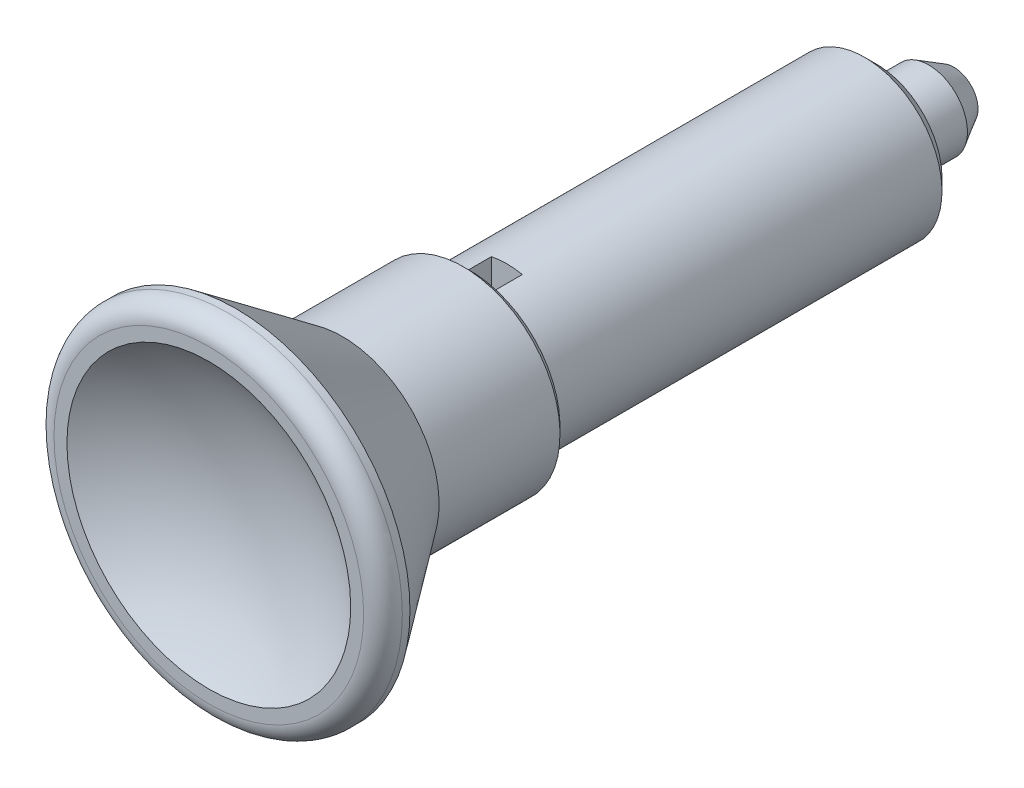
ISO-10303-21;
HEADER;
FILE_DESCRIPTION(('STEP AP214'),'2;1');
FILE_NAME('part.step','',(''),(''),'','','');
FILE_SCHEMA(('AUTOMOTIVE_DESIGN { 1 0 10303 214 1 1 1 1 }'));
ENDSEC;
DATA;
#1=APPLICATION_CONTEXT('core data for automotive mechanical design processes');
#2=APPLICATION_PROTOCOL_DEFINITION('international standard','automotive_design',2000,#1);
#3=PRODUCT_CONTEXT('',#1,'mechanical');
#4=PRODUCT('Part','Part','',(#3));
#5=PRODUCT_RELATED_PRODUCT_CATEGORY('part','',(#4));
#6=PRODUCT_DEFINITION_FORMATION('','',#4);
#7=PRODUCT_DEFINITION_CONTEXT('part definition',#1,'design');
#8=PRODUCT_DEFINITION('design','',#6,#7);
#9=PRODUCT_DEFINITION_SHAPE('','',#8);
#10=(LENGTH_UNIT() NAMED_UNIT(*) SI_UNIT(.MILLI.,.METRE.));
#11=(NAMED_UNIT(*) PLANE_ANGLE_UNIT() SI_UNIT($,.RADIAN.));
#12=(NAMED_UNIT(*) SI_UNIT($,.STERADIAN.) SOLID_ANGLE_UNIT());
#13=UNCERTAINTY_MEASURE_WITH_UNIT(LENGTH_MEASURE(1.E-05),#10,'distance_accuracy_value','');
#14=(GEOMETRIC_REPRESENTATION_CONTEXT(3) GLOBAL_UNCERTAINTY_ASSIGNED_CONTEXT((#13)) GLOBAL_UNIT_ASSIGNED_CONTEXT((#10,
#11,#12)) REPRESENTATION_CONTEXT('',''));
#15=CARTESIAN_POINT('',(0.,0.,0.));
#16=DIRECTION('',(0.,0.,1.));
#17=DIRECTION('',(1.,0.,0.));
#18=AXIS2_PLACEMENT_3D('',#15,#16,#17);
#19=CARTESIAN_POINT('',(-0.8,-10.,19.1));
#20=DIRECTION('',(0.,0.,1.));
#21=DIRECTION('',(0.,-1.,0.));
#22=AXIS2_PLACEMENT_3D('',#19,#20,#21);
#23=PLANE('',#22);
#24=DIRECTION('',(0.,1.,0.));
#25=VECTOR('',#24,1.);
#26=CARTESIAN_POINT('',(-0.8,-10.,19.1));
#27=LINE('',#26,#25);
#28=CARTESIAN_POINT('',(-0.8,-3.91918358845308,19.1));
#29=VERTEX_POINT('',#28);
#30=CARTESIAN_POINT('',(-0.8,-1.83303027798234,19.1));
#31=VERTEX_POINT('',#30);
#32=EDGE_CURVE('E87',#29,#31,#27,.T.);
#33=ORIENTED_EDGE('',*,*,#32,.F.);
#34=CARTESIAN_POINT('',(0.,0.,19.1));
#35=DIRECTION('',(0.,0.,1.));
#36=DIRECTION('',(0.,-1.,0.));
#37=AXIS2_PLACEMENT_3D('',#34,#35,#36);
#38=CIRCLE('',#37,4.);
#39=CARTESIAN_POINT('',(0.8,-3.91918358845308,19.1));
#40=VERTEX_POINT('',#39);
#41=EDGE_CURVE('E79',#29,#40,#38,.T.);
#42=ORIENTED_EDGE('',*,*,#41,.T.);
#43=DIRECTION('',(0.,-1.,0.));
#44=VECTOR('',#43,1.);
#45=CARTESIAN_POINT('',(0.8,-10.,19.1));
#46=LINE('',#45,#44);
#47=CARTESIAN_POINT('',(0.8,-1.83303027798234,19.1));
#48=VERTEX_POINT('',#47);
#49=EDGE_CURVE('E84',#48,#40,#46,.T.);
#50=ORIENTED_EDGE('',*,*,#49,.F.);
#51=CARTESIAN_POINT('',(0.,0.,19.1));
#52=DIRECTION('',(0.,0.,1.));
#53=DIRECTION('',(0.,-1.,0.));
#54=AXIS2_PLACEMENT_3D('',#51,#52,#53);
#55=CIRCLE('',#54,2.);
#56=EDGE_CURVE('E89',#31,#48,#55,.T.);
#57=ORIENTED_EDGE('',*,*,#56,.F.);
#58=EDGE_LOOP('',(#33,#42,#50,#57));
#59=FACE_BOUND('',#58,.T.);
#60=ADVANCED_FACE('F14',(#59),#23,.T.);
#61=CARTESIAN_POINT('',(0.,0.,-4.));
#62=DIRECTION('',(0.,0.,1.));
#63=DIRECTION('',(0.,-1.,0.));
#64=AXIS2_PLACEMENT_3D('',#61,#62,#63);
#65=CYLINDRICAL_SURFACE('',#64,2.);
#66=DIRECTION('',(0.,0.,1.));
#67=VECTOR('',#66,1.);
#68=CARTESIAN_POINT('',(0.8,-1.83303027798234,19.1));
#69=LINE('',#68,#67);
#70=CARTESIAN_POINT('',(0.8,-1.83303027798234,21.));
#71=VERTEX_POINT('',#70);
#72=EDGE_CURVE('E98',#71,#48,#69,.F.);
#73=ORIENTED_EDGE('',*,*,#72,.F.);
#74=CARTESIAN_POINT('',(0.,0.,21.));
#75=DIRECTION('',(0.,0.,1.));
#76=DIRECTION('',(0.,-1.,0.));
#77=AXIS2_PLACEMENT_3D('',#74,#75,#76);
#78=CIRCLE('',#77,2.);
#79=CARTESIAN_POINT('',(-0.8,-1.83303027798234,21.));
#80=VERTEX_POINT('',#79);
#81=EDGE_CURVE('E246',#71,#80,#78,.F.);
#82=ORIENTED_EDGE('',*,*,#81,.T.);
#83=DIRECTION('',(0.,0.,1.));
#84=VECTOR('',#83,1.);
#85=CARTESIAN_POINT('',(-0.8,-1.83303027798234,21.));
#86=LINE('',#85,#84);
#87=EDGE_CURVE('E120',#31,#80,#86,.T.);
#88=ORIENTED_EDGE('',*,*,#87,.F.);
#89=ORIENTED_EDGE('',*,*,#56,.T.);
#90=EDGE_LOOP('',(#73,#82,#88,#89));
#91=FACE_BOUND('',#90,.T.);
#92=ADVANCED_FACE('F252',(#91),#65,.T.);
#93=CARTESIAN_POINT('',(-0.8,-10.,19.1));
#94=DIRECTION('',(0.,0.,1.));
#95=DIRECTION('',(0.,-1.,0.));
#96=AXIS2_PLACEMENT_3D('',#93,#94,#95);
#97=PLANE('',#96);
#98=DIRECTION('',(0.,-1.,0.));
#99=VECTOR('',#98,1.);
#100=CARTESIAN_POINT('',(0.8,-10.,19.1));
#101=LINE('',#100,#99);
#102=CARTESIAN_POINT('',(0.8,3.91918358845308,19.1));
#103=VERTEX_POINT('',#102);
#104=CARTESIAN_POINT('',(0.8,1.83303027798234,19.1));
#105=VERTEX_POINT('',#104);
#106=EDGE_CURVE('E116',#103,#105,#101,.T.);
#107=ORIENTED_EDGE('',*,*,#106,.F.);
#108=CARTESIAN_POINT('',(0.,0.,19.1));
#109=DIRECTION('',(0.,0.,1.));
#110=DIRECTION('',(0.,-1.,0.));
#111=AXIS2_PLACEMENT_3D('',#108,#109,#110);
#112=CIRCLE('',#111,4.);
#113=CARTESIAN_POINT('',(-0.8,3.91918358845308,19.1));
#114=VERTEX_POINT('',#113);
#115=EDGE_CURVE('E250',#103,#114,#112,.T.);
#116=ORIENTED_EDGE('',*,*,#115,.T.);
#117=DIRECTION('',(0.,1.,0.));
#118=VECTOR('',#117,1.);
#119=CARTESIAN_POINT('',(-0.8,-10.,19.1));
#120=LINE('',#119,#118);
#121=CARTESIAN_POINT('',(-0.8,1.83303027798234,19.1));
#122=VERTEX_POINT('',#121);
#123=EDGE_CURVE('E119',#122,#114,#120,.T.);
#124=ORIENTED_EDGE('',*,*,#123,.F.);
#125=CARTESIAN_POINT('',(0.,0.,19.1));
#126=DIRECTION('',(0.,0.,1.));
#127=DIRECTION('',(0.,-1.,0.));
#128=AXIS2_PLACEMENT_3D('',#125,#126,#127);
#129=CIRCLE('',#128,2.);
#130=EDGE_CURVE('E127',#105,#122,#129,.T.);
#131=ORIENTED_EDGE('',*,*,#130,.F.);
#132=EDGE_LOOP('',(#107,#116,#124,#131));
#133=FACE_BOUND('',#132,.T.);
#134=ADVANCED_FACE('F377',(#133),#97,.T.);
#135=CARTESIAN_POINT('',(0.,0.,-4.));
#136=DIRECTION('',(0.,0.,1.));
#137=DIRECTION('',(0.,-1.,0.));
#138=AXIS2_PLACEMENT_3D('',#135,#136,#137);
#139=CYLINDRICAL_SURFACE('',#138,2.);
#140=DIRECTION('',(0.,0.,1.));
#141=VECTOR('',#140,1.);
#142=CARTESIAN_POINT('',(0.8,1.83303027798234,19.1));
#143=LINE('',#142,#141);
#144=CARTESIAN_POINT('',(0.8,1.83303027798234,21.));
#145=VERTEX_POINT('',#144);
#146=EDGE_CURVE('E111',#105,#145,#143,.T.);
#147=ORIENTED_EDGE('',*,*,#146,.F.);
#148=ORIENTED_EDGE('',*,*,#130,.T.);
#149=DIRECTION('',(0.,0.,1.));
#150=VECTOR('',#149,1.);
#151=CARTESIAN_POINT('',(-0.8,1.83303027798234,21.));
#152=LINE('',#151,#150);
#153=CARTESIAN_POINT('',(-0.8,1.83303027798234,21.));
#154=VERTEX_POINT('',#153);
#155=EDGE_CURVE('E117',#154,#122,#152,.F.);
#156=ORIENTED_EDGE('',*,*,#155,.F.);
#157=CARTESIAN_POINT('',(0.,0.,21.));
#158=DIRECTION('',(0.,0.,1.));
#159=DIRECTION('',(0.,-1.,0.));
#160=AXIS2_PLACEMENT_3D('',#157,#158,#159);
#161=CIRCLE('',#160,2.);
#162=EDGE_CURVE('E234',#154,#145,#161,.F.);
#163=ORIENTED_EDGE('',*,*,#162,.T.);
#164=EDGE_LOOP('',(#147,#148,#156,#163));
#165=FACE_BOUND('',#164,.T.);
#166=ADVANCED_FACE('F369',(#165),#139,.T.);
#167=CARTESIAN_POINT('',(0.8,-10.,19.1));
#168=DIRECTION('',(-1.,0.,0.));
#169=DIRECTION('',(0.,-1.,0.));
#170=AXIS2_PLACEMENT_3D('',#167,#168,#169);
#171=PLANE('',#170);
#172=ORIENTED_EDGE('',*,*,#49,.T.);
#173=DIRECTION('',(0.,0.,1.));
#174=VECTOR('',#173,1.);
#175=CARTESIAN_POINT('',(0.8,-3.91918358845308,0.));
#176=LINE('',#175,#174);
#177=CARTESIAN_POINT('',(0.8,-3.91918358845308,21.));
#178=VERTEX_POINT('',#177);
#179=EDGE_CURVE('E95',#178,#40,#176,.F.);
#180=ORIENTED_EDGE('',*,*,#179,.F.);
#181=DIRECTION('',(0.,-1.,0.));
#182=VECTOR('',#181,1.);
#183=CARTESIAN_POINT('',(0.8,0.,21.));
#184=LINE('',#183,#182);
#185=EDGE_CURVE('E123',#178,#71,#184,.F.);
#186=ORIENTED_EDGE('',*,*,#185,.T.);
#187=ORIENTED_EDGE('',*,*,#72,.T.);
#188=EDGE_LOOP('',(#172,#180,#186,#187));
#189=FACE_BOUND('',#188,.T.);
#190=ADVANCED_FACE('F93',(#189),#171,.T.);
#191=CARTESIAN_POINT('',(-0.8,-10.,21.));
#192=DIRECTION('',(1.,0.,0.));
#193=DIRECTION('',(0.,1.,0.));
#194=AXIS2_PLACEMENT_3D('',#191,#192,#193);
#195=PLANE('',#194);
#196=DIRECTION('',(0.,-1.,0.));
#197=VECTOR('',#196,1.);
#198=CARTESIAN_POINT('',(-0.8,0.,21.));
#199=LINE('',#198,#197);
#200=CARTESIAN_POINT('',(-0.8,-3.91918358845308,21.));
#201=VERTEX_POINT('',#200);
#202=EDGE_CURVE('E241',#80,#201,#199,.T.);
#203=ORIENTED_EDGE('',*,*,#202,.T.);
#204=DIRECTION('',(0.,0.,1.));
#205=VECTOR('',#204,1.);
#206=CARTESIAN_POINT('',(-0.8,-3.91918358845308,0.));
#207=LINE('',#206,#205);
#208=EDGE_CURVE('E106',#29,#201,#207,.T.);
#209=ORIENTED_EDGE('',*,*,#208,.F.);
#210=ORIENTED_EDGE('',*,*,#32,.T.);
#211=ORIENTED_EDGE('',*,*,#87,.T.);
#212=EDGE_LOOP('',(#203,#209,#210,#211));
#213=FACE_BOUND('',#212,.T.);
#214=ADVANCED_FACE('F353',(#213),#195,.T.);
#215=CARTESIAN_POINT('',(-0.8,-10.,21.));
#216=DIRECTION('',(1.,0.,0.));
#217=DIRECTION('',(0.,1.,0.));
#218=AXIS2_PLACEMENT_3D('',#215,#216,#217);
#219=PLANE('',#218);
#220=ORIENTED_EDGE('',*,*,#123,.T.);
#221=DIRECTION('',(0.,0.,1.));
#222=VECTOR('',#221,1.);
#223=CARTESIAN_POINT('',(-0.8,3.91918358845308,0.));
#224=LINE('',#223,#222);
#225=CARTESIAN_POINT('',(-0.8,3.91918358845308,21.));
#226=VERTEX_POINT('',#225);
#227=EDGE_CURVE('E109',#226,#114,#224,.F.);
#228=ORIENTED_EDGE('',*,*,#227,.F.);
#229=DIRECTION('',(0.,-1.,0.));
#230=VECTOR('',#229,1.);
#231=CARTESIAN_POINT('',(-0.8,0.,21.));
#232=LINE('',#231,#230);
#233=EDGE_CURVE('E236',#226,#154,#232,.T.);
#234=ORIENTED_EDGE('',*,*,#233,.T.);
#235=ORIENTED_EDGE('',*,*,#155,.T.);
#236=EDGE_LOOP('',(#220,#228,#234,#235));
#237=FACE_BOUND('',#236,.T.);
#238=ADVANCED_FACE('F345',(#237),#219,.T.);
#239=CARTESIAN_POINT('',(0.8,-10.,19.1));
#240=DIRECTION('',(-1.,0.,0.));
#241=DIRECTION('',(0.,-1.,0.));
#242=AXIS2_PLACEMENT_3D('',#239,#240,#241);
#243=PLANE('',#242);
#244=DIRECTION('',(0.,-1.,0.));
#245=VECTOR('',#244,1.);
#246=CARTESIAN_POINT('',(0.8,0.,21.));
#247=LINE('',#246,#245);
#248=CARTESIAN_POINT('',(0.8,3.91918358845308,21.));
#249=VERTEX_POINT('',#248);
#250=EDGE_CURVE('E33',#145,#249,#247,.F.);
#251=ORIENTED_EDGE('',*,*,#250,.T.);
#252=DIRECTION('',(0.,0.,1.));
#253=VECTOR('',#252,1.);
#254=CARTESIAN_POINT('',(0.8,3.91918358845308,0.));
#255=LINE('',#254,#253);
#256=EDGE_CURVE('E107',#103,#249,#255,.T.);
#257=ORIENTED_EDGE('',*,*,#256,.F.);
#258=ORIENTED_EDGE('',*,*,#106,.T.);
#259=ORIENTED_EDGE('',*,*,#146,.T.);
#260=EDGE_LOOP('',(#251,#257,#258,#259));
#261=FACE_BOUND('',#260,.T.);
#262=ADVANCED_FACE('F338',(#261),#243,.T.);
#263=CARTESIAN_POINT('',(0.,0.,0.));
#264=DIRECTION('',(0.,0.,1.));
#265=DIRECTION('',(0.,-1.,0.));
#266=AXIS2_PLACEMENT_3D('',#263,#264,#265);
#267=CYLINDRICAL_SURFACE('',#266,4.);
#268=ORIENTED_EDGE('',*,*,#227,.T.);
#269=ORIENTED_EDGE('',*,*,#115,.F.);
#270=ORIENTED_EDGE('',*,*,#256,.T.);
#271=CARTESIAN_POINT('',(0.,0.,21.));
#272=DIRECTION('',(0.,0.,1.));
#273=DIRECTION('',(0.,-1.,0.));
#274=AXIS2_PLACEMENT_3D('',#271,#272,#273);
#275=CIRCLE('',#274,4.);
#276=EDGE_CURVE('E104',#249,#178,#275,.F.);
#277=ORIENTED_EDGE('',*,*,#276,.T.);
#278=ORIENTED_EDGE('',*,*,#179,.T.);
#279=ORIENTED_EDGE('',*,*,#41,.F.);
#280=ORIENTED_EDGE('',*,*,#208,.T.);
#281=CARTESIAN_POINT('',(0.,0.,21.));
#282=DIRECTION('',(0.,0.,1.));
#283=DIRECTION('',(0.,-1.,0.));
#284=AXIS2_PLACEMENT_3D('',#281,#282,#283);
#285=CIRCLE('',#284,4.);
#286=EDGE_CURVE('E238',#201,#226,#285,.F.);
#287=ORIENTED_EDGE('',*,*,#286,.T.);
#288=EDGE_LOOP('',(#268,#269,#270,#277,#278,#279,#280,#287));
#289=FACE_BOUND('',#288,.T.);
#290=CARTESIAN_POINT('',(0.,0.,0.6135));
#291=DIRECTION('',(0.,0.,1.));
#292=DIRECTION('',(0.,-1.,0.));
#293=AXIS2_PLACEMENT_3D('',#290,#291,#292);
#294=CIRCLE('',#293,4.);
#295=CARTESIAN_POINT('',(0.,-4.,0.6135));
#296=VERTEX_POINT('',#295);
#297=EDGE_CURVE('E90',#296,#296,#294,.T.);
#298=ORIENTED_EDGE('',*,*,#297,.T.);
#299=EDGE_LOOP('',(#298));
#300=FACE_BOUND('',#299,.T.);
#301=ADVANCED_FACE('F101',(#289,#300),#267,.T.);
#302=CARTESIAN_POINT('',(0.,0.,44.));
#303=DIRECTION('',(-1.,0.,0.));
#304=DIRECTION('',(0.,1.,0.));
#305=AXIS2_PLACEMENT_3D('',#302,#303,#304);
#306=SPHERICAL_SURFACE('',#305,12.);
#307=CARTESIAN_POINT('',(0.,7.33143914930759,34.5));
#308=CARTESIAN_POINT('',(-0.205979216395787,7.33144062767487,34.5));
#309=CARTESIAN_POINT('',(-0.411934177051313,7.32275500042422,34.5));
#310=CARTESIAN_POINT('',(-0.822448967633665,7.28807311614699,34.5));
#311=CARTESIAN_POINT('',(-1.02700841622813,7.26207230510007,34.5));
#312=CARTESIAN_POINT('',(-1.43338925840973,7.19290757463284,34.5));
#313=CARTESIAN_POINT('',(-1.63520804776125,7.14972837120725,34.5));
#314=CARTESIAN_POINT('',(-2.03456261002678,7.04649589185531,34.5));
#315=CARTESIAN_POINT('',(-2.2320967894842,6.98643645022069,34.5));
#316=CARTESIAN_POINT('',(-2.62123343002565,6.84993539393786,34.5));
#317=CARTESIAN_POINT('',(-2.81284076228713,6.77350766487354,34.5));
#318=CARTESIAN_POINT('',(-3.1890058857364,6.60475219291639,34.5));
#319=CARTESIAN_POINT('',(-3.37356105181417,6.51241859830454,34.5));
#320=CARTESIAN_POINT('',(-3.73412260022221,6.31258951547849,34.5));
#321=CARTESIAN_POINT('',(-3.91013419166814,6.20510342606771,34.5));
#322=CARTESIAN_POINT('',(-4.25254330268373,5.97564762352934,34.5));
#323=CARTESIAN_POINT('',(-4.418937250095,5.85367257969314,34.5));
#324=CARTESIAN_POINT('',(-4.7408149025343,5.59617198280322,34.5));
#325=CARTESIAN_POINT('',(-4.89630147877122,5.46065001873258,34.5));
#326=CARTESIAN_POINT('',(-5.19536308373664,5.17693929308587,34.5));
#327=CARTESIAN_POINT('',(-5.33893369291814,5.02874587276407,34.5));
#328=CARTESIAN_POINT('',(-5.61303290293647,4.72084015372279,34.5));
#329=CARTESIAN_POINT('',(-5.7435657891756,4.56113166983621,34.5));
#330=CARTESIAN_POINT('',(-5.99076141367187,4.23122666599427,34.5));
#331=CARTESIAN_POINT('',(-6.10741901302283,4.06102629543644,34.5));
#332=CARTESIAN_POINT('',(-6.32593592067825,3.71146912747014,34.5));
#333=CARTESIAN_POINT('',(-6.427800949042,3.53211590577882,34.5));
#334=CARTESIAN_POINT('',(-6.61609753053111,3.16539948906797,34.5));
#335=CARTESIAN_POINT('',(-6.70252337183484,2.97803336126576,34.5));
#336=CARTESIAN_POINT('',(-6.85925134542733,2.59675511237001,34.5));
#337=CARTESIAN_POINT('',(-6.92955944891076,2.40284544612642,34.5));
#338=CARTESIAN_POINT('',(-7.05361703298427,2.00972472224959,34.5));
#339=CARTESIAN_POINT('',(-7.10736039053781,1.81051173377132,34.5));
#340=CARTESIAN_POINT('',(-7.19785168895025,1.40832460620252,34.5));
#341=CARTESIAN_POINT('',(-7.23460586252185,1.20535187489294,34.5));
#342=CARTESIAN_POINT('',(-7.29090733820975,0.797013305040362,34.5));
#343=CARTESIAN_POINT('',(-7.31044828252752,0.591646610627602,34.5));
#344=CARTESIAN_POINT('',(-7.34293703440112,-0.0257030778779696,34.5));
#345=CARTESIAN_POINT('',(-7.32984889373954,-0.439373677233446,34.5));
#346=CARTESIAN_POINT('',(-7.23440515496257,-1.25842018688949,34.5));
#347=CARTESIAN_POINT('',(-7.15204953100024,-1.66379609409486,34.5));
#348=CARTESIAN_POINT('',(-6.92045134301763,-2.45502887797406,34.5));
#349=CARTESIAN_POINT('',(-6.77120870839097,-2.84088573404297,34.5));
#350=CARTESIAN_POINT('',(-6.41006162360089,-3.58205069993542,34.5));
#351=CARTESIAN_POINT('',(-6.19815719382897,-3.93735881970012,34.5));
#352=CARTESIAN_POINT('',(-5.71770502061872,-4.60736046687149,34.5));
#353=CARTESIAN_POINT('',(-5.44915730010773,-4.92205401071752,34.5));
#354=CARTESIAN_POINT('',(-4.86304090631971,-5.50188805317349,34.5));
#355=CARTESIAN_POINT('',(-4.54547222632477,-5.76702854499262,34.5));
#356=CARTESIAN_POINT('',(-3.87032895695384,-6.24023136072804,34.5));
#357=CARTESIAN_POINT('',(-3.51275436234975,-6.44829367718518,34.5));
#358=CARTESIAN_POINT('',(-2.76774974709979,-6.80143341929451,34.5));
#359=CARTESIAN_POINT('',(-2.38031972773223,-6.94651084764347,34.5));
#360=CARTESIAN_POINT('',(-1.58660228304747,-7.16956260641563,34.5));
#361=CARTESIAN_POINT('',(-1.18031485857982,-7.24753693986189,34.5));
#362=CARTESIAN_POINT('',(-0.360415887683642,-7.33416902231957,34.5));
#363=CARTESIAN_POINT('',(0.0531956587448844,-7.34282677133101,34.5));
#364=CARTESIAN_POINT('',(0.876001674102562,-7.29057995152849,34.5));
#365=CARTESIAN_POINT('',(1.28519614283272,-7.22967537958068,34.5));
#366=CARTESIAN_POINT('',(2.08755217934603,-7.04003270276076,34.5));
#367=CARTESIAN_POINT('',(2.48071374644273,-6.91129459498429,34.5));
#368=CARTESIAN_POINT('',(3.23984318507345,-6.5896397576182,34.5));
#369=CARTESIAN_POINT('',(3.60581106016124,-6.39672303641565,34.5));
#370=CARTESIAN_POINT('',(4.30016446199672,-5.95218586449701,34.5));
#371=CARTESIAN_POINT('',(4.62854999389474,-5.70056542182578,34.5));
#372=CARTESIAN_POINT('',(5.23841666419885,-5.14576893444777,34.5));
#373=CARTESIAN_POINT('',(5.51989778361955,-4.84259286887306,34.5));
#374=CARTESIAN_POINT('',(6.02796636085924,-4.19327088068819,34.5));
#375=CARTESIAN_POINT('',(6.25455380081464,-3.84712494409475,34.5));
#376=CARTESIAN_POINT('',(6.64639792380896,-3.12176625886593,34.5));
#377=CARTESIAN_POINT('',(6.81165467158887,-2.74255354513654,34.5));
#378=CARTESIAN_POINT('',(7.07616375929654,-1.96154033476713,34.5));
#379=CARTESIAN_POINT('',(7.17541612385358,-1.55973984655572,34.5));
#380=CARTESIAN_POINT('',(7.27266504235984,-0.949232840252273,34.5));
#381=CARTESIAN_POINT('',(7.29647530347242,-0.744317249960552,34.5));
#382=CARTESIAN_POINT('',(7.32675599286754,-0.333229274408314,34.5));
#383=CARTESIAN_POINT('',(7.33323281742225,-0.127057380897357,34.5));
#384=CARTESIAN_POINT('',(7.32879308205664,0.285160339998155,34.5));
#385=CARTESIAN_POINT('',(7.31787013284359,0.491206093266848,34.5));
#386=CARTESIAN_POINT('',(7.2787105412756,0.90157265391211,34.5));
#387=CARTESIAN_POINT('',(7.25048029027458,1.10589406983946,34.5));
#388=CARTESIAN_POINT('',(7.17689678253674,1.51150746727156,34.5));
#389=CARTESIAN_POINT('',(7.13153717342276,1.71279829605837,34.5));
#390=CARTESIAN_POINT('',(7.02403888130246,2.11076896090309,34.5));
#391=CARTESIAN_POINT('',(6.96190639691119,2.30745047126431,34.5));
#392=CARTESIAN_POINT('',(6.82126899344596,2.69495656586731,34.5));
#393=CARTESIAN_POINT('',(6.74275773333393,2.88577884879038,34.5));
#394=CARTESIAN_POINT('',(6.56996778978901,3.26006032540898,34.5));
#395=CARTESIAN_POINT('',(6.47569493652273,3.44352221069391,34.5));
#396=CARTESIAN_POINT('',(6.27199785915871,3.80191279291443,34.5));
#397=CARTESIAN_POINT('',(6.1625686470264,3.97683865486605,34.5));
#398=CARTESIAN_POINT('',(5.92940387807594,4.31678543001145,34.5));
#399=CARTESIAN_POINT('',(5.80567361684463,4.48180997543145,34.5));
#400=CARTESIAN_POINT('',(5.54471896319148,4.80089374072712,34.5));
#401=CARTESIAN_POINT('',(5.40749101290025,4.95495005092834,34.5));
#402=CARTESIAN_POINT('',(5.12059718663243,5.25089919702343,34.5));
#403=CARTESIAN_POINT('',(4.97093591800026,5.39279649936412,34.5));
#404=CARTESIAN_POINT('',(4.66009879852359,5.66356684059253,34.5));
#405=CARTESIAN_POINT('',(4.49891588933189,5.79243177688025,34.5));
#406=CARTESIAN_POINT('',(4.16632566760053,6.0360756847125,34.5));
#407=CARTESIAN_POINT('',(3.99492214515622,6.15085983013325,34.5));
#408=CARTESIAN_POINT('',(3.6429059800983,6.36567249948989,34.5));
#409=CARTESIAN_POINT('',(3.46228567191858,6.46568846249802,34.5));
#410=CARTESIAN_POINT('',(3.09332440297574,6.65010265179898,34.5));
#411=CARTESIAN_POINT('',(2.90498628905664,6.73450657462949,34.5));
#412=CARTESIAN_POINT('',(2.52203405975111,6.88707373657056,34.5));
#413=CARTESIAN_POINT('',(2.32742568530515,6.95525137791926,34.5));
#414=CARTESIAN_POINT('',(1.93322420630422,7.07496111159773,34.5));
#415=CARTESIAN_POINT('',(1.73363242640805,7.12649757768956,34.5));
#416=CARTESIAN_POINT('',(1.2806433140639,7.2233023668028,34.5));
#417=CARTESIAN_POINT('',(1.02621667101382,7.26381924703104,34.5));
#418=CARTESIAN_POINT('',(0.514514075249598,7.31788671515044,34.5));
#419=CARTESIAN_POINT('',(0.25723812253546,7.33143730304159,34.5));
#420=CARTESIAN_POINT('',(0.,7.33143914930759,34.5));
#421=B_SPLINE_CURVE_WITH_KNOTS('',3,(#307,#308,#309,#310,#311,#312,#313,#314,#315,#316,#317,
#318,#319,#320,#321,#322,#323,#324,#325,#326,#327,#328,#329,#330,#331,#332,#333,#334,#335,#336,
#337,#338,#339,#340,#341,#342,#343,#344,#345,#346,#347,#348,#349,#350,#351,#352,#353,#354,#355,
#356,#357,#358,#359,#360,#361,#362,#363,#364,#365,#366,#367,#368,#369,#370,#371,#372,#373,#374,
#375,#376,#377,#378,#379,#380,#381,#382,#383,#384,#385,#386,#387,#388,#389,#390,#391,#392,#393,
#394,#395,#396,#397,#398,#399,#400,#401,#402,#403,#404,#405,#406,#407,#408,#409,#410,#411,#412,
#413,#414,#415,#416,#417,#418,#419,#420),.UNSPECIFIED.,.T.,.F.,(4,2,2,2,2,2,2,2,2,2,2,2,2,2,2,2,
2,2,2,2,2,2,2,2,2,2,2,2,2,2,2,2,2,2,2,2,2,2,2,2,2,2,2,2,2,2,2,2,2,2,2,2,2,2,2,2,4),(0.,
0.61771295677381,1.2355884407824,1.85401489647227,2.47266753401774,3.09079741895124,
3.7091551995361,4.32713109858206,4.94533506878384,5.56337569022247,6.18164452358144,
6.7997094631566,7.41800260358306,8.03605601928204,8.65433761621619,9.27238978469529,
9.89067013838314,10.5087234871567,11.1270050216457,12.3622384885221,13.5974724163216,
14.8327076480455,16.067942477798,17.3031768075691,18.5384113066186,19.7736459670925,
21.0088805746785,22.244115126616,23.4793496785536,24.7145842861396,25.9498189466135,
27.1850534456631,28.4202877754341,29.6555226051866,30.8907578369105,32.1259917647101,
33.3612252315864,33.9795067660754,34.597560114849,35.2158404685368,35.8338926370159,
36.4521742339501,37.070227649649,37.6885207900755,38.3065857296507,38.9248545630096,
39.5428951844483,40.16109915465,40.779075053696,41.3974328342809,42.0155627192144,
42.6342153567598,43.2526418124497,43.8705172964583,44.4882302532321,45.2596640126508,
46.0310977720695),.UNSPECIFIED.);
#422=CARTESIAN_POINT('',(0.,7.33143914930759,34.5));
#423=VERTEX_POINT('',#422);
#424=EDGE_CURVE('E148',#423,#423,#421,.T.);
#425=ORIENTED_EDGE('',*,*,#424,.T.);
#426=EDGE_LOOP('',(#425));
#427=FACE_BOUND('',#426,.T.);
#428=ADVANCED_FACE('F157',(#427),#306,.F.);
#429=CARTESIAN_POINT('',(4.64644660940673,0.,21.));
#430=DIRECTION('',(0.,0.,1.));
#431=DIRECTION('',(0.,-1.,0.));
#432=AXIS2_PLACEMENT_3D('',#429,#430,#431);
#433=PLANE('',#432);
#434=CARTESIAN_POINT('',(0.,0.,20.9999999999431));
#435=DIRECTION('',(0.,0.,1.));
#436=DIRECTION('',(0.,-1.,0.));
#437=AXIS2_PLACEMENT_3D('',#434,#435,#436);
#438=CIRCLE('',#437,4.64644660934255);
#439=CARTESIAN_POINT('',(0.,-4.64644660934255,20.9999999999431));
#440=VERTEX_POINT('',#439);
#441=EDGE_CURVE('E144',#440,#440,#438,.T.);
#442=ORIENTED_EDGE('',*,*,#441,.F.);
#443=EDGE_LOOP('',(#442));
#444=FACE_BOUND('',#443,.T.);
#445=ORIENTED_EDGE('',*,*,#250,.F.);
#446=ORIENTED_EDGE('',*,*,#162,.F.);
#447=ORIENTED_EDGE('',*,*,#233,.F.);
#448=ORIENTED_EDGE('',*,*,#286,.F.);
#449=ORIENTED_EDGE('',*,*,#202,.F.);
#450=ORIENTED_EDGE('',*,*,#81,.F.);
#451=ORIENTED_EDGE('',*,*,#185,.F.);
#452=ORIENTED_EDGE('',*,*,#276,.F.);
#453=EDGE_LOOP('',(#445,#446,#447,#448,#449,#450,#451,#452));
#454=FACE_BOUND('',#453,.T.);
#455=ADVANCED_FACE('F166',(#444,#454),#433,.F.);
#456=CARTESIAN_POINT('',(7.33143914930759,0.,34.5));
#457=DIRECTION('',(0.,0.,-1.));
#458=DIRECTION('',(0.,1.,0.));
#459=AXIS2_PLACEMENT_3D('',#456,#457,#458);
#460=PLANE('',#459);
#461=ORIENTED_EDGE('',*,*,#424,.F.);
#462=EDGE_LOOP('',(#461));
#463=FACE_BOUND('',#462,.T.);
#464=CARTESIAN_POINT('',(0.,0.,34.5));
#465=DIRECTION('',(0.,0.,-1.));
#466=DIRECTION('',(0.,1.,0.));
#467=AXIS2_PLACEMENT_3D('',#464,#465,#466);
#468=CIRCLE('',#467,8.);
#469=CARTESIAN_POINT('',(0.,8.,34.5));
#470=VERTEX_POINT('',#469);
#471=EDGE_CURVE('E147',#470,#470,#468,.T.);
#472=ORIENTED_EDGE('',*,*,#471,.F.);
#473=EDGE_LOOP('',(#472));
#474=FACE_BOUND('',#473,.T.);
#475=ADVANCED_FACE('F161',(#463,#474),#460,.F.);
#476=CARTESIAN_POINT('',(0.,0.,21.3535533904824));
#477=DIRECTION('',(0.,0.,1.));
#478=DIRECTION('',(0.,-1.,0.));
#479=AXIS2_PLACEMENT_3D('',#476,#477,#478);
#480=CONICAL_SURFACE('',#479,4.99999999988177,0.785398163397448);
#481=CARTESIAN_POINT('',(0.,0.,21.3535533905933));
#482=DIRECTION('',(0.,0.,1.));
#483=DIRECTION('',(0.,-1.,0.));
#484=AXIS2_PLACEMENT_3D('',#481,#482,#483);
#485=CIRCLE('',#484,5.);
#486=CARTESIAN_POINT('',(0.,-5.,21.3535533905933));
#487=VERTEX_POINT('',#486);
#488=EDGE_CURVE('E205',#487,#487,#485,.T.);
#489=ORIENTED_EDGE('',*,*,#488,.F.);
#490=EDGE_LOOP('',(#489));
#491=FACE_BOUND('',#490,.T.);
#492=ORIENTED_EDGE('',*,*,#441,.T.);
#493=EDGE_LOOP('',(#492));
#494=FACE_BOUND('',#493,.T.);
#495=ADVANCED_FACE('F165',(#491,#494),#480,.T.);
#496=CARTESIAN_POINT('',(0.,0.,33.5));
#497=DIRECTION('',(0.,0.,-1.));
#498=DIRECTION('',(0.,1.,0.));
#499=AXIS2_PLACEMENT_3D('',#496,#497,#498);
#500=TOROIDAL_SURFACE('',#499,8.,1.);
#501=CARTESIAN_POINT('',(0.,0.,33.5));
#502=DIRECTION('',(0.,0.,1.));
#503=DIRECTION('',(0.,-1.,0.));
#504=AXIS2_PLACEMENT_3D('',#501,#502,#503);
#505=CIRCLE('',#504,9.);
#506=CARTESIAN_POINT('',(0.,-9.,33.5));
#507=VERTEX_POINT('',#506);
#508=EDGE_CURVE('E208',#507,#507,#505,.F.);
#509=ORIENTED_EDGE('',*,*,#508,.F.);
#510=EDGE_LOOP('',(#509));
#511=FACE_BOUND('',#510,.T.);
#512=ORIENTED_EDGE('',*,*,#471,.T.);
#513=EDGE_LOOP('',(#512));
#514=FACE_BOUND('',#513,.T.);
#515=ADVANCED_FACE('F189',(#511,#514),#500,.T.);
#516=CARTESIAN_POINT('',(0.,0.,-4.));
#517=DIRECTION('',(0.,0.,1.));
#518=DIRECTION('',(0.,-1.,0.));
#519=AXIS2_PLACEMENT_3D('',#516,#517,#518);
#520=CYLINDRICAL_SURFACE('',#519,5.);
#521=CARTESIAN_POINT('',(0.,0.,27.6));
#522=DIRECTION('',(0.,0.,1.));
#523=DIRECTION('',(0.,-1.,0.));
#524=AXIS2_PLACEMENT_3D('',#521,#522,#523);
#525=CIRCLE('',#524,5.);
#526=CARTESIAN_POINT('',(0.,-5.,27.6));
#527=VERTEX_POINT('',#526);
#528=EDGE_CURVE('E24',#527,#527,#525,.T.);
#529=ORIENTED_EDGE('',*,*,#528,.F.);
#530=EDGE_LOOP('',(#529));
#531=FACE_BOUND('',#530,.T.);
#532=ORIENTED_EDGE('',*,*,#488,.T.);
#533=EDGE_LOOP('',(#532));
#534=FACE_BOUND('',#533,.T.);
#535=ADVANCED_FACE('F198',(#531,#534),#520,.T.);
#536=CARTESIAN_POINT('',(0.,0.,-4.));
#537=DIRECTION('',(0.,0.,1.));
#538=DIRECTION('',(0.,-1.,0.));
#539=AXIS2_PLACEMENT_3D('',#536,#537,#538);
#540=CYLINDRICAL_SURFACE('',#539,9.);
#541=ORIENTED_EDGE('',*,*,#508,.T.);
#542=EDGE_LOOP('',(#541));
#543=FACE_BOUND('',#542,.T.);
#544=CARTESIAN_POINT('',(0.,0.,33.1055276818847));
#545=DIRECTION('',(0.,0.,1.));
#546=DIRECTION('',(0.,-1.,0.));
#547=AXIS2_PLACEMENT_3D('',#544,#545,#546);
#548=CIRCLE('',#547,9.);
#549=CARTESIAN_POINT('',(0.,-9.,33.1055276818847));
#550=VERTEX_POINT('',#549);
#551=EDGE_CURVE('E9',#550,#550,#548,.F.);
#552=ORIENTED_EDGE('',*,*,#551,.F.);
#553=EDGE_LOOP('',(#552));
#554=FACE_BOUND('',#553,.T.);
#555=ADVANCED_FACE('F224',(#543,#554),#540,.T.);
#556=CARTESIAN_POINT('',(0.,0.,33.1055276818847));
#557=DIRECTION('',(0.,0.,1.));
#558=DIRECTION('',(-1.,0.,0.));
#559=AXIS2_PLACEMENT_3D('',#556,#557,#558);
#560=CONICAL_SURFACE('',#559,9.,0.628318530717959);
#561=ORIENTED_EDGE('',*,*,#551,.T.);
#562=EDGE_LOOP('',(#561));
#563=FACE_BOUND('',#562,.T.);
#564=ORIENTED_EDGE('',*,*,#528,.T.);
#565=EDGE_LOOP('',(#564));
#566=FACE_BOUND('',#565,.T.);
#567=ADVANCED_FACE('F220',(#563,#566),#560,.T.);
#568=CARTESIAN_POINT('',(1.24944465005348,0.,-4.));
#569=DIRECTION('',(0.,0.,1.));
#570=DIRECTION('',(0.,-1.,0.));
#571=AXIS2_PLACEMENT_3D('',#568,#569,#570);
#572=PLANE('',#571);
#573=CARTESIAN_POINT('',(0.,0.,-3.99999999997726));
#574=DIRECTION('',(0.,0.,1.));
#575=DIRECTION('',(-1.,0.,0.));
#576=AXIS2_PLACEMENT_3D('',#573,#574,#575);
#577=CIRCLE('',#576,1.24944465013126);
#578=CARTESIAN_POINT('',(-1.24944465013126,0.,-3.99999999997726));
#579=VERTEX_POINT('',#578);
#580=EDGE_CURVE('E18',#579,#579,#577,.T.);
#581=ORIENTED_EDGE('',*,*,#580,.F.);
#582=EDGE_LOOP('',(#581));
#583=FACE_BOUND('',#582,.T.);
#584=ADVANCED_FACE('F16',(#583),#572,.F.);
#585=CARTESIAN_POINT('',(0.,0.,-2.70000000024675));
#586=DIRECTION('',(0.,0.,1.));
#587=DIRECTION('',(-1.,0.,0.));
#588=AXIS2_PLACEMENT_3D('',#585,#586,#587);
#589=CONICAL_SURFACE('',#588,1.99999999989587,0.523598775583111);
#590=CARTESIAN_POINT('',(0.,0.,-2.7));
#591=DIRECTION('',(0.,0.,1.));
#592=DIRECTION('',(0.,-1.,0.));
#593=AXIS2_PLACEMENT_3D('',#590,#591,#592);
#594=CIRCLE('',#593,2.);
#595=CARTESIAN_POINT('',(0.,-2.,-2.7));
#596=VERTEX_POINT('',#595);
#597=EDGE_CURVE('E138',#596,#596,#594,.T.);
#598=ORIENTED_EDGE('',*,*,#597,.F.);
#599=EDGE_LOOP('',(#598));
#600=FACE_BOUND('',#599,.T.);
#601=ORIENTED_EDGE('',*,*,#580,.T.);
#602=EDGE_LOOP('',(#601));
#603=FACE_BOUND('',#602,.T.);
#604=ADVANCED_FACE('F276',(#600,#603),#589,.T.);
#605=CARTESIAN_POINT('',(0.,0.,-4.));
#606=DIRECTION('',(0.,0.,1.));
#607=DIRECTION('',(0.,-1.,0.));
#608=AXIS2_PLACEMENT_3D('',#605,#606,#607);
#609=CYLINDRICAL_SURFACE('',#608,2.);
#610=CARTESIAN_POINT('',(0.,0.,0.));
#611=DIRECTION('',(0.,0.,1.));
#612=DIRECTION('',(0.,-1.,0.));
#613=AXIS2_PLACEMENT_3D('',#610,#611,#612);
#614=CIRCLE('',#613,2.);
#615=CARTESIAN_POINT('',(0.,-2.,0.));
#616=VERTEX_POINT('',#615);
#617=EDGE_CURVE('E141',#616,#616,#614,.F.);
#618=ORIENTED_EDGE('',*,*,#617,.T.);
#619=EDGE_LOOP('',(#618));
#620=FACE_BOUND('',#619,.T.);
#621=ORIENTED_EDGE('',*,*,#597,.T.);
#622=EDGE_LOOP('',(#621));
#623=FACE_BOUND('',#622,.T.);
#624=ADVANCED_FACE('F260',(#620,#623),#609,.T.);
#625=CARTESIAN_POINT('',(3.3865,0.,0.));
#626=DIRECTION('',(0.,0.,1.));
#627=DIRECTION('',(0.,-1.,0.));
#628=AXIS2_PLACEMENT_3D('',#625,#626,#627);
#629=PLANE('',#628);
#630=CARTESIAN_POINT('',(0.,0.,9.86814796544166E-11));
#631=DIRECTION('',(0.,0.,1.));
#632=DIRECTION('',(0.,-1.,0.));
#633=AXIS2_PLACEMENT_3D('',#630,#631,#632);
#634=CIRCLE('',#633,3.38650000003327);
#635=CARTESIAN_POINT('',(0.,-3.38650000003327,9.86814796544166E-11));
#636=VERTEX_POINT('',#635);
#637=EDGE_CURVE('E135',#636,#636,#634,.T.);
#638=ORIENTED_EDGE('',*,*,#637,.F.);
#639=EDGE_LOOP('',(#638));
#640=FACE_BOUND('',#639,.T.);
#641=ORIENTED_EDGE('',*,*,#617,.F.);
#642=EDGE_LOOP('',(#641));
#643=FACE_BOUND('',#642,.T.);
#644=ADVANCED_FACE('F263',(#640,#643),#629,.F.);
#645=CARTESIAN_POINT('',(0.,0.,0.613499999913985));
#646=DIRECTION('',(0.,0.,1.));
#647=DIRECTION('',(0.,-1.,0.));
#648=AXIS2_PLACEMENT_3D('',#645,#646,#647);
#649=CONICAL_SURFACE('',#648,3.99999999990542,0.785398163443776);
#650=ORIENTED_EDGE('',*,*,#297,.F.);
#651=EDGE_LOOP('',(#650));
#652=FACE_BOUND('',#651,.T.);
#653=ORIENTED_EDGE('',*,*,#637,.T.);
#654=EDGE_LOOP('',(#653));
#655=FACE_BOUND('',#654,.T.);
#656=ADVANCED_FACE('F265',(#652,#655),#649,.T.);
#657=CLOSED_SHELL('',(#60,#92,#134,#166,#190,#214,#238,#262,#301,#428,#455,#475,#495,#515,#535,
#555,#567,#584,#604,#624,#644,#656));
#658=MANIFOLD_SOLID_BREP('B1',#657);
#659=ADVANCED_BREP_SHAPE_REPRESENTATION('',(#18,#658),#14);
#660=SHAPE_DEFINITION_REPRESENTATION(#9,#659);
ENDSEC;
END-ISO-10303-21;
